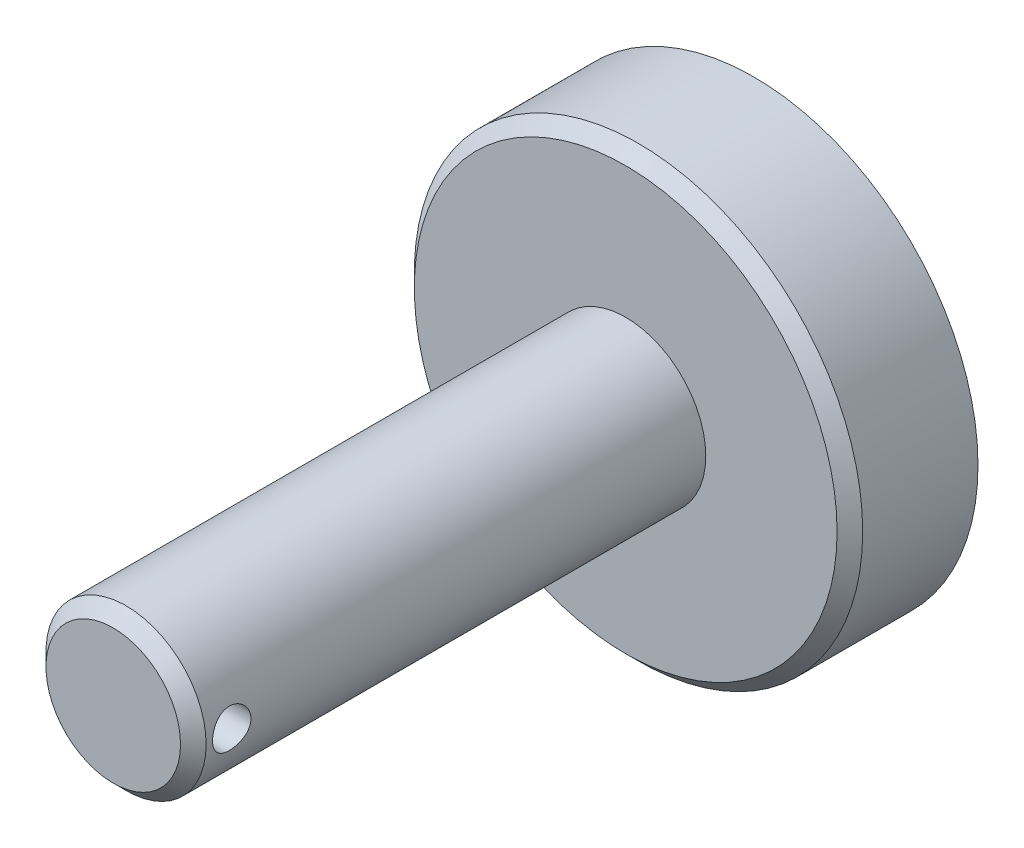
ISO-10303-21;
HEADER;
FILE_DESCRIPTION(('STEP AP214'),'2;1');
FILE_NAME('part.step','',(''),(''),'','','');
FILE_SCHEMA(('AUTOMOTIVE_DESIGN { 1 0 10303 214 1 1 1 1 }'));
ENDSEC;
DATA;
#1=APPLICATION_CONTEXT('core data for automotive mechanical design processes');
#2=APPLICATION_PROTOCOL_DEFINITION('international standard','automotive_design',2000,#1);
#3=PRODUCT_CONTEXT('',#1,'mechanical');
#4=PRODUCT('Part','Part','',(#3));
#5=PRODUCT_RELATED_PRODUCT_CATEGORY('part','',(#4));
#6=PRODUCT_DEFINITION_FORMATION('','',#4);
#7=PRODUCT_DEFINITION_CONTEXT('part definition',#1,'design');
#8=PRODUCT_DEFINITION('design','',#6,#7);
#9=PRODUCT_DEFINITION_SHAPE('','',#8);
#10=(LENGTH_UNIT() NAMED_UNIT(*) SI_UNIT(.MILLI.,.METRE.));
#11=(NAMED_UNIT(*) PLANE_ANGLE_UNIT() SI_UNIT($,.RADIAN.));
#12=(NAMED_UNIT(*) SI_UNIT($,.STERADIAN.) SOLID_ANGLE_UNIT());
#13=UNCERTAINTY_MEASURE_WITH_UNIT(LENGTH_MEASURE(1.E-05),#10,'distance_accuracy_value','');
#14=(GEOMETRIC_REPRESENTATION_CONTEXT(3) GLOBAL_UNCERTAINTY_ASSIGNED_CONTEXT((#13)) GLOBAL_UNIT_ASSIGNED_CONTEXT((#10,
#11,#12)) REPRESENTATION_CONTEXT('',''));
#15=CARTESIAN_POINT('',(0.,0.,0.));
#16=DIRECTION('',(0.,0.,1.));
#17=DIRECTION('',(1.,0.,0.));
#18=AXIS2_PLACEMENT_3D('',#15,#16,#17);
#19=CARTESIAN_POINT('',(0.,0.,20.));
#20=DIRECTION('',(0.,0.,1.));
#21=DIRECTION('',(1.,0.,0.));
#22=AXIS2_PLACEMENT_3D('',#19,#20,#21);
#23=PLANE('',#22);
#24=CARTESIAN_POINT('',(0.,0.,20.));
#25=DIRECTION('',(0.,0.,1.));
#26=DIRECTION('',(1.,0.,0.));
#27=AXIS2_PLACEMENT_3D('',#24,#25,#26);
#28=CIRCLE('',#27,33.);
#29=CARTESIAN_POINT('',(33.,0.,20.));
#30=VERTEX_POINT('',#29);
#31=EDGE_CURVE('E43',#30,#30,#28,.T.);
#32=ORIENTED_EDGE('',*,*,#31,.T.);
#33=EDGE_LOOP('',(#32));
#34=FACE_BOUND('',#33,.T.);
#35=CARTESIAN_POINT('',(0.,0.,20.));
#36=DIRECTION('',(0.,0.,1.));
#37=DIRECTION('',(1.,0.,0.));
#38=AXIS2_PLACEMENT_3D('',#35,#36,#37);
#39=CIRCLE('',#38,12.5);
#40=CARTESIAN_POINT('',(12.5,0.,20.));
#41=VERTEX_POINT('',#40);
#42=EDGE_CURVE('E96',#41,#41,#39,.T.);
#43=ORIENTED_EDGE('',*,*,#42,.F.);
#44=EDGE_LOOP('',(#43));
#45=FACE_BOUND('',#44,.T.);
#46=ADVANCED_FACE('F31',(#34,#45),#23,.T.);
#47=CARTESIAN_POINT('',(0.,0.,20.));
#48=DIRECTION('',(0.,0.,-1.));
#49=DIRECTION('',(-1.,0.,0.));
#50=AXIS2_PLACEMENT_3D('',#47,#48,#49);
#51=CYLINDRICAL_SURFACE('',#50,35.);
#52=CARTESIAN_POINT('',(0.,0.,18.));
#53=DIRECTION('',(0.,0.,1.));
#54=DIRECTION('',(1.,0.,0.));
#55=AXIS2_PLACEMENT_3D('',#52,#53,#54);
#56=CIRCLE('',#55,35.);
#57=CARTESIAN_POINT('',(35.,0.,18.));
#58=VERTEX_POINT('',#57);
#59=EDGE_CURVE('E10',#58,#58,#56,.F.);
#60=ORIENTED_EDGE('',*,*,#59,.T.);
#61=EDGE_LOOP('',(#60));
#62=FACE_BOUND('',#61,.T.);
#63=CARTESIAN_POINT('',(0.,0.,0.));
#64=DIRECTION('',(0.,0.,1.));
#65=DIRECTION('',(1.,0.,0.));
#66=AXIS2_PLACEMENT_3D('',#63,#64,#65);
#67=CIRCLE('',#66,35.);
#68=CARTESIAN_POINT('',(35.,0.,0.));
#69=VERTEX_POINT('',#68);
#70=EDGE_CURVE('E93',#69,#69,#67,.T.);
#71=ORIENTED_EDGE('',*,*,#70,.T.);
#72=EDGE_LOOP('',(#71));
#73=FACE_BOUND('',#72,.T.);
#74=ADVANCED_FACE('F33',(#62,#73),#51,.T.);
#75=CARTESIAN_POINT('',(0.,0.,0.));
#76=DIRECTION('',(0.,0.,1.));
#77=DIRECTION('',(1.,0.,0.));
#78=AXIS2_PLACEMENT_3D('',#75,#76,#77);
#79=PLANE('',#78);
#80=ORIENTED_EDGE('',*,*,#70,.F.);
#81=EDGE_LOOP('',(#80));
#82=FACE_BOUND('',#81,.T.);
#83=ADVANCED_FACE('F78',(#82),#79,.F.);
#84=CARTESIAN_POINT('',(0.,0.,100.));
#85=DIRECTION('',(0.,0.,-1.));
#86=DIRECTION('',(-1.,0.,0.));
#87=AXIS2_PLACEMENT_3D('',#84,#85,#86);
#88=CYLINDRICAL_SURFACE('',#87,12.5);
#89=CARTESIAN_POINT('',(-12.5,0.,97.));
#90=CARTESIAN_POINT('',(-12.4999970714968,-0.165963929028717,96.9999949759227));
#91=CARTESIAN_POINT('',(-12.4966615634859,-0.331985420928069,96.9861815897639));
#92=CARTESIAN_POINT('',(-12.4836783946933,-0.659284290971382,96.9313672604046));
#93=CARTESIAN_POINT('',(-12.4740268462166,-0.820558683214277,96.8903495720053));
#94=CARTESIAN_POINT('',(-12.4494823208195,-1.13358839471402,96.7825076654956));
#95=CARTESIAN_POINT('',(-12.4345953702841,-1.28535442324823,96.7157131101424));
#96=CARTESIAN_POINT('',(-12.4011725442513,-1.57552517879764,96.5583145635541));
#97=CARTESIAN_POINT('',(-12.3826366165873,-1.71392971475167,96.4677102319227));
#98=CARTESIAN_POINT('',(-12.3435386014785,-1.97609263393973,96.2634358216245));
#99=CARTESIAN_POINT('',(-12.3229472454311,-2.09955952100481,96.1493972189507));
#100=CARTESIAN_POINT('',(-12.2822574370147,-2.32581080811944,95.9022811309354));
#101=CARTESIAN_POINT('',(-12.2621590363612,-2.4285930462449,95.7692016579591));
#102=CARTESIAN_POINT('',(-12.224437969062,-2.61189993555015,95.4855541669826));
#103=CARTESIAN_POINT('',(-12.2068525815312,-2.69210377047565,95.3347734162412));
#104=CARTESIAN_POINT('',(-12.1765733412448,-2.82591582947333,95.0213801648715));
#105=CARTESIAN_POINT('',(-12.1638787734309,-2.87952794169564,94.8587693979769));
#106=CARTESIAN_POINT('',(-12.1451184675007,-2.95765058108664,94.5295234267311));
#107=CARTESIAN_POINT('',(-12.1389341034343,-2.98268262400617,94.3630188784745));
#108=CARTESIAN_POINT('',(-12.1335389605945,-3.00455808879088,94.0280676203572));
#109=CARTESIAN_POINT('',(-12.1343271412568,-3.001405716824,93.8596212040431));
#110=CARTESIAN_POINT('',(-12.1426811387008,-2.96741912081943,93.5295240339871));
#111=CARTESIAN_POINT('',(-12.1500960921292,-2.93720103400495,93.3678054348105));
#112=CARTESIAN_POINT('',(-12.1706283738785,-2.8509214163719,93.0518026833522));
#113=CARTESIAN_POINT('',(-12.1837460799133,-2.79485817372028,92.8975190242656));
#114=CARTESIAN_POINT('',(-12.2143476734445,-2.65794121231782,92.5990870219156));
#115=CARTESIAN_POINT('',(-12.2318714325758,-2.5768594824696,92.4550475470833));
#116=CARTESIAN_POINT('',(-12.2692875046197,-2.39236688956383,92.1823954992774));
#117=CARTESIAN_POINT('',(-12.2891802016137,-2.28895240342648,92.0537854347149));
#118=CARTESIAN_POINT('',(-12.329732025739,-2.05951493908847,91.8121064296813));
#119=CARTESIAN_POINT('',(-12.3503975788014,-1.93297064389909,91.6995329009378));
#120=CARTESIAN_POINT('',(-12.3896951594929,-1.66255592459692,91.4971152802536));
#121=CARTESIAN_POINT('',(-12.4083271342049,-1.51868504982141,91.4072717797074));
#122=CARTESIAN_POINT('',(-12.4415394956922,-1.21702847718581,91.2527027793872));
#123=CARTESIAN_POINT('',(-12.4561077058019,-1.05920278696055,91.1880525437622));
#124=CARTESIAN_POINT('',(-12.4794620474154,-0.73449760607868,91.0863349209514));
#125=CARTESIAN_POINT('',(-12.4882491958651,-0.567619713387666,91.0492626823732));
#126=CARTESIAN_POINT('',(-12.4989027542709,-0.233787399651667,91.004497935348));
#127=CARTESIAN_POINT('',(-12.5009282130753,-0.0669284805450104,90.9961301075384));
#128=CARTESIAN_POINT('',(-12.4982807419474,0.265804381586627,91.0071667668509));
#129=CARTESIAN_POINT('',(-12.4936083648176,0.43167840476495,91.0265689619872));
#130=CARTESIAN_POINT('',(-12.4781916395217,0.755422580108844,91.0920369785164));
#131=CARTESIAN_POINT('',(-12.4675301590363,0.913370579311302,91.1377391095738));
#132=CARTESIAN_POINT('',(-12.4413335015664,1.21935330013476,91.2540981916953));
#133=CARTESIAN_POINT('',(-12.4257978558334,1.3673870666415,91.3247575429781));
#134=CARTESIAN_POINT('',(-12.3911910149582,1.6520615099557,91.4903665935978));
#135=CARTESIAN_POINT('',(-12.3720653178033,1.78847176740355,91.5857007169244));
#136=CARTESIAN_POINT('',(-12.3324936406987,2.04359904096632,91.7974569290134));
#137=CARTESIAN_POINT('',(-12.3120474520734,2.16231325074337,91.9138823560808));
#138=CARTESIAN_POINT('',(-12.2715742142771,2.38142453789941,92.1676408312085));
#139=CARTESIAN_POINT('',(-12.2515669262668,2.4813497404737,92.3053851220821));
#140=CARTESIAN_POINT('',(-12.2147538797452,2.65666020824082,92.5960904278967));
#141=CARTESIAN_POINT('',(-12.1979479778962,2.7320465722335,92.7490507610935));
#142=CARTESIAN_POINT('',(-12.1696189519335,2.85558993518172,93.065012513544));
#143=CARTESIAN_POINT('',(-12.1580647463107,2.90390754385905,93.2279482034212));
#144=CARTESIAN_POINT('',(-12.1415072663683,2.97238380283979,93.5599461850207));
#145=CARTESIAN_POINT('',(-12.1365026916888,2.99254804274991,93.7290072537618));
#146=CARTESIAN_POINT('',(-12.1337046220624,3.00387066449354,94.0636707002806));
#147=CARTESIAN_POINT('',(-12.1357241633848,2.99578106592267,94.2292464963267));
#148=CARTESIAN_POINT('',(-12.1463176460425,2.95253345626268,94.5565997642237));
#149=CARTESIAN_POINT('',(-12.1548914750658,2.91737590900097,94.7183773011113));
#150=CARTESIAN_POINT('',(-12.1775274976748,2.82138591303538,95.0327975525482));
#151=CARTESIAN_POINT('',(-12.191561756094,2.76068402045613,95.1854822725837));
#152=CARTESIAN_POINT('',(-12.2235433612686,2.61543373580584,95.4786044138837));
#153=CARTESIAN_POINT('',(-12.2414912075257,2.53088229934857,95.6190402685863));
#154=CARTESIAN_POINT('',(-12.279819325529,2.33793007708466,95.8873370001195));
#155=CARTESIAN_POINT('',(-12.3002478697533,2.2290026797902,96.0148123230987));
#156=CARTESIAN_POINT('',(-12.3409359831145,1.99143074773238,96.2499199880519));
#157=CARTESIAN_POINT('',(-12.361195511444,1.86278158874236,96.3575476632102));
#158=CARTESIAN_POINT('',(-12.3996570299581,1.58688299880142,96.5516092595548));
#159=CARTESIAN_POINT('',(-12.4178200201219,1.43936414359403,96.637668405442));
#160=CARTESIAN_POINT('',(-12.4496380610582,1.13153622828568,96.7836295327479));
#161=CARTESIAN_POINT('',(-12.4632965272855,0.97123697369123,96.8435513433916));
#162=CARTESIAN_POINT('',(-12.4824059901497,0.675887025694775,96.9260386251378));
#163=CARTESIAN_POINT('',(-12.4889599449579,0.542312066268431,96.9537166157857));
#164=CARTESIAN_POINT('',(-12.4977580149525,0.272504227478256,96.9906987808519));
#165=CARTESIAN_POINT('',(-12.5000024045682,0.13627151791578,97.0000041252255));
#166=CARTESIAN_POINT('',(-12.5,0.,97.));
#167=B_SPLINE_CURVE_WITH_KNOTS('',3,(#89,#90,#91,#92,#93,#94,#95,#96,#97,#98,#99,#100,#101,#102,
#103,#104,#105,#106,#107,#108,#109,#110,#111,#112,#113,#114,#115,#116,#117,#118,#119,#120,#121,
#122,#123,#124,#125,#126,#127,#128,#129,#130,#131,#132,#133,#134,#135,#136,#137,#138,#139,#140,
#141,#142,#143,#144,#145,#146,#147,#148,#149,#150,#151,#152,#153,#154,#155,#156,#157,#158,#159,
#160,#161,#162,#163,#164,#165,#166),.UNSPECIFIED.,.T.,.F.,(4,2,2,2,2,2,2,2,2,2,2,2,2,2,2,2,2,2,
2,2,2,2,2,2,2,2,2,2,2,2,2,2,2,2,2,2,2,2,4),(0.,0.497392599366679,0.995091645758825,
1.49221966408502,1.9893547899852,2.49500570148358,3.00070943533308,3.51327262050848,
4.02576083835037,4.52873995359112,5.03164400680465,5.52338274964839,6.0151540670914,
6.51154667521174,7.00801987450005,7.51749958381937,8.02699254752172,8.53799614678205,
9.04890983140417,9.54771776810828,10.0464845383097,10.5385143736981,11.0305915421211,
11.5308523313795,12.0311923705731,12.5427824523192,13.0543496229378,13.5628484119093,
14.0712462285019,14.5662165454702,15.06117838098,15.5536406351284,16.0461657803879,
16.5505844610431,17.055121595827,17.5678974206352,18.0802835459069,18.4887142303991,
18.8971189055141),.UNSPECIFIED.);
#168=CARTESIAN_POINT('',(-12.5,0.,97.));
#169=VERTEX_POINT('',#168);
#170=EDGE_CURVE('E35',#169,#169,#167,.T.);
#171=ORIENTED_EDGE('',*,*,#170,.T.);
#172=EDGE_LOOP('',(#171));
#173=FACE_BOUND('',#172,.T.);
#174=CARTESIAN_POINT('',(12.5,0.,91.));
#175=CARTESIAN_POINT('',(12.4999970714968,-0.165963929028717,91.0000050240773));
#176=CARTESIAN_POINT('',(12.4966615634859,-0.331985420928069,91.0138184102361));
#177=CARTESIAN_POINT('',(12.4836783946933,-0.659284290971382,91.0686327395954));
#178=CARTESIAN_POINT('',(12.4740268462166,-0.820558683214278,91.1096504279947));
#179=CARTESIAN_POINT('',(12.4494823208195,-1.13358839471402,91.2174923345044));
#180=CARTESIAN_POINT('',(12.4345953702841,-1.28535442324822,91.2842868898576));
#181=CARTESIAN_POINT('',(12.4011725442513,-1.57552517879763,91.4416854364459));
#182=CARTESIAN_POINT('',(12.3826366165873,-1.71392971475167,91.5322897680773));
#183=CARTESIAN_POINT('',(12.3435386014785,-1.97609263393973,91.7365641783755));
#184=CARTESIAN_POINT('',(12.3229472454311,-2.0995595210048,91.8506027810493));
#185=CARTESIAN_POINT('',(12.2822574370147,-2.32581080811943,92.0977188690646));
#186=CARTESIAN_POINT('',(12.2621590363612,-2.4285930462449,92.2307983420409));
#187=CARTESIAN_POINT('',(12.224437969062,-2.61189993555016,92.5144458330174));
#188=CARTESIAN_POINT('',(12.2068525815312,-2.69210377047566,92.6652265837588));
#189=CARTESIAN_POINT('',(12.1765733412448,-2.82591582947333,92.9786198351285));
#190=CARTESIAN_POINT('',(12.1638787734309,-2.87952794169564,93.1412306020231));
#191=CARTESIAN_POINT('',(12.1451184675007,-2.95765058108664,93.4704765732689));
#192=CARTESIAN_POINT('',(12.1389341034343,-2.98268262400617,93.6369811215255));
#193=CARTESIAN_POINT('',(12.1335389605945,-3.00455808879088,93.9719323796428));
#194=CARTESIAN_POINT('',(12.1343271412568,-3.001405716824,94.1403787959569));
#195=CARTESIAN_POINT('',(12.1426811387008,-2.96741912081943,94.4704759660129));
#196=CARTESIAN_POINT('',(12.1500960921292,-2.93720103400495,94.6321945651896));
#197=CARTESIAN_POINT('',(12.1706283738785,-2.85092141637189,94.9481973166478));
#198=CARTESIAN_POINT('',(12.1837460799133,-2.79485817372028,95.1024809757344));
#199=CARTESIAN_POINT('',(12.2143476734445,-2.65794121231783,95.4009129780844));
#200=CARTESIAN_POINT('',(12.2318714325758,-2.57685948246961,95.5449524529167));
#201=CARTESIAN_POINT('',(12.2692875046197,-2.39236688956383,95.8176045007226));
#202=CARTESIAN_POINT('',(12.2891802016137,-2.28895240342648,95.9462145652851));
#203=CARTESIAN_POINT('',(12.329732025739,-2.05951493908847,96.1878935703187));
#204=CARTESIAN_POINT('',(12.3503975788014,-1.93297064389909,96.3004670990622));
#205=CARTESIAN_POINT('',(12.3896951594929,-1.66255592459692,96.5028847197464));
#206=CARTESIAN_POINT('',(12.4083271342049,-1.51868504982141,96.5927282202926));
#207=CARTESIAN_POINT('',(12.4415394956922,-1.21702847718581,96.7472972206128));
#208=CARTESIAN_POINT('',(12.4561077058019,-1.05920278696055,96.8119474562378));
#209=CARTESIAN_POINT('',(12.4794620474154,-0.73449760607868,96.9136650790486));
#210=CARTESIAN_POINT('',(12.4882491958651,-0.567619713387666,96.9507373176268));
#211=CARTESIAN_POINT('',(12.4989027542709,-0.233787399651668,96.995502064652));
#212=CARTESIAN_POINT('',(12.5009282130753,-0.0669284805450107,97.0038698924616));
#213=CARTESIAN_POINT('',(12.4982807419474,0.265804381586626,96.9928332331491));
#214=CARTESIAN_POINT('',(12.4936083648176,0.431678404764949,96.9734310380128));
#215=CARTESIAN_POINT('',(12.4781916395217,0.755422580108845,96.9079630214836));
#216=CARTESIAN_POINT('',(12.4675301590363,0.913370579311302,96.8622608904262));
#217=CARTESIAN_POINT('',(12.4413335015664,1.21935330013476,96.7459018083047));
#218=CARTESIAN_POINT('',(12.4257978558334,1.3673870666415,96.6752424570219));
#219=CARTESIAN_POINT('',(12.3911910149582,1.6520615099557,96.5096334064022));
#220=CARTESIAN_POINT('',(12.3720653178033,1.78847176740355,96.4142992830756));
#221=CARTESIAN_POINT('',(12.3324936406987,2.04359904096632,96.2025430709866));
#222=CARTESIAN_POINT('',(12.3120474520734,2.16231325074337,96.0861176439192));
#223=CARTESIAN_POINT('',(12.2715742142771,2.38142453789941,95.8323591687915));
#224=CARTESIAN_POINT('',(12.2515669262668,2.4813497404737,95.6946148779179));
#225=CARTESIAN_POINT('',(12.2147538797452,2.65666020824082,95.4039095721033));
#226=CARTESIAN_POINT('',(12.1979479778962,2.7320465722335,95.2509492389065));
#227=CARTESIAN_POINT('',(12.1696189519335,2.85558993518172,94.934987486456));
#228=CARTESIAN_POINT('',(12.1580647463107,2.90390754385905,94.7720517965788));
#229=CARTESIAN_POINT('',(12.1415072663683,2.97238380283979,94.4400538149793));
#230=CARTESIAN_POINT('',(12.1365026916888,2.99254804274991,94.2709927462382));
#231=CARTESIAN_POINT('',(12.1337046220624,3.00387066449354,93.9363292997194));
#232=CARTESIAN_POINT('',(12.1357241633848,2.99578106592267,93.7707535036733));
#233=CARTESIAN_POINT('',(12.1463176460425,2.95253345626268,93.4434002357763));
#234=CARTESIAN_POINT('',(12.1548914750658,2.91737590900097,93.2816226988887));
#235=CARTESIAN_POINT('',(12.1775274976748,2.82138591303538,92.9672024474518));
#236=CARTESIAN_POINT('',(12.191561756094,2.76068402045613,92.8145177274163));
#237=CARTESIAN_POINT('',(12.2235433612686,2.61543373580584,92.5213955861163));
#238=CARTESIAN_POINT('',(12.2414912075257,2.53088229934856,92.3809597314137));
#239=CARTESIAN_POINT('',(12.279819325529,2.33793007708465,92.1126629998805));
#240=CARTESIAN_POINT('',(12.3002478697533,2.2290026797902,91.9851876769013));
#241=CARTESIAN_POINT('',(12.3409359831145,1.99143074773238,91.7500800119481));
#242=CARTESIAN_POINT('',(12.361195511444,1.86278158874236,91.6424523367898));
#243=CARTESIAN_POINT('',(12.3996570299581,1.58688299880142,91.4483907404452));
#244=CARTESIAN_POINT('',(12.4178200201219,1.43936414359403,91.362331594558));
#245=CARTESIAN_POINT('',(12.4496380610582,1.13153622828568,91.2163704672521));
#246=CARTESIAN_POINT('',(12.4632965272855,0.971236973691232,91.1564486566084));
#247=CARTESIAN_POINT('',(12.4824059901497,0.675887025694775,91.0739613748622));
#248=CARTESIAN_POINT('',(12.4889599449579,0.542312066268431,91.0462833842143));
#249=CARTESIAN_POINT('',(12.4977580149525,0.272504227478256,91.0093012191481));
#250=CARTESIAN_POINT('',(12.5000024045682,0.13627151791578,90.9999958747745));
#251=CARTESIAN_POINT('',(12.5,0.,91.));
#252=B_SPLINE_CURVE_WITH_KNOTS('',3,(#174,#175,#176,#177,#178,#179,#180,#181,#182,#183,#184,
#185,#186,#187,#188,#189,#190,#191,#192,#193,#194,#195,#196,#197,#198,#199,#200,#201,#202,#203,
#204,#205,#206,#207,#208,#209,#210,#211,#212,#213,#214,#215,#216,#217,#218,#219,#220,#221,#222,
#223,#224,#225,#226,#227,#228,#229,#230,#231,#232,#233,#234,#235,#236,#237,#238,#239,#240,#241,
#242,#243,#244,#245,#246,#247,#248,#249,#250,#251),.UNSPECIFIED.,.T.,.F.,(4,2,2,2,2,2,2,2,2,2,2,
2,2,2,2,2,2,2,2,2,2,2,2,2,2,2,2,2,2,2,2,2,2,2,2,2,2,2,4),(0.,0.497392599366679,
0.995091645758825,1.49221966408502,1.9893547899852,2.49500570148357,3.00070943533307,
3.51327262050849,4.02576083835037,4.52873995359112,5.03164400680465,5.5233827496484,
6.0151540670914,6.51154667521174,7.00801987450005,7.51749958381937,8.02699254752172,
8.53799614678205,9.04890983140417,9.54771776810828,10.0464845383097,10.5385143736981,
11.0305915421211,11.5308523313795,12.0311923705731,12.5427824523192,13.0543496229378,
13.5628484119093,14.0712462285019,14.5662165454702,15.06117838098,15.5536406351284,
16.0461657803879,16.5505844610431,17.055121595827,17.5678974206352,18.0802835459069,
18.4887142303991,18.8971189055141),.UNSPECIFIED.);
#253=CARTESIAN_POINT('',(12.5,0.,91.));
#254=VERTEX_POINT('',#253);
#255=EDGE_CURVE('E51',#254,#254,#252,.T.);
#256=ORIENTED_EDGE('',*,*,#255,.T.);
#257=EDGE_LOOP('',(#256));
#258=FACE_BOUND('',#257,.T.);
#259=CARTESIAN_POINT('',(0.,0.,98.));
#260=DIRECTION('',(0.,0.,1.));
#261=DIRECTION('',(1.,0.,0.));
#262=AXIS2_PLACEMENT_3D('',#259,#260,#261);
#263=CIRCLE('',#262,12.5);
#264=CARTESIAN_POINT('',(12.5,0.,98.));
#265=VERTEX_POINT('',#264);
#266=EDGE_CURVE('E48',#265,#265,#263,.F.);
#267=ORIENTED_EDGE('',*,*,#266,.T.);
#268=EDGE_LOOP('',(#267));
#269=FACE_BOUND('',#268,.T.);
#270=ORIENTED_EDGE('',*,*,#42,.T.);
#271=EDGE_LOOP('',(#270));
#272=FACE_BOUND('',#271,.T.);
#273=ADVANCED_FACE('F55',(#173,#258,#269,#272),#88,.T.);
#274=CARTESIAN_POINT('',(0.,0.,100.));
#275=DIRECTION('',(0.,0.,1.));
#276=DIRECTION('',(1.,0.,0.));
#277=AXIS2_PLACEMENT_3D('',#274,#275,#276);
#278=PLANE('',#277);
#279=CARTESIAN_POINT('',(0.,0.,100.));
#280=DIRECTION('',(0.,0.,1.));
#281=DIRECTION('',(1.,0.,0.));
#282=AXIS2_PLACEMENT_3D('',#279,#280,#281);
#283=CIRCLE('',#282,10.5);
#284=CARTESIAN_POINT('',(10.5,0.,100.));
#285=VERTEX_POINT('',#284);
#286=EDGE_CURVE('E95',#285,#285,#283,.T.);
#287=ORIENTED_EDGE('',*,*,#286,.T.);
#288=EDGE_LOOP('',(#287));
#289=FACE_BOUND('',#288,.T.);
#290=ADVANCED_FACE('F71',(#289),#278,.T.);
#291=CARTESIAN_POINT('',(0.,0.,100.));
#292=DIRECTION('',(0.,0.,-1.));
#293=DIRECTION('',(-1.,0.,0.));
#294=AXIS2_PLACEMENT_3D('',#291,#292,#293);
#295=CONICAL_SURFACE('',#294,10.5,0.785398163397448);
#296=ORIENTED_EDGE('',*,*,#266,.F.);
#297=EDGE_LOOP('',(#296));
#298=FACE_BOUND('',#297,.T.);
#299=ORIENTED_EDGE('',*,*,#286,.F.);
#300=EDGE_LOOP('',(#299));
#301=FACE_BOUND('',#300,.T.);
#302=ADVANCED_FACE('F68',(#298,#301),#295,.T.);
#303=CARTESIAN_POINT('',(0.,0.,20.));
#304=DIRECTION('',(0.,0.,-1.));
#305=DIRECTION('',(-1.,0.,0.));
#306=AXIS2_PLACEMENT_3D('',#303,#304,#305);
#307=CONICAL_SURFACE('',#306,33.,0.785398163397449);
#308=ORIENTED_EDGE('',*,*,#59,.F.);
#309=EDGE_LOOP('',(#308));
#310=FACE_BOUND('',#309,.T.);
#311=ORIENTED_EDGE('',*,*,#31,.F.);
#312=EDGE_LOOP('',(#311));
#313=FACE_BOUND('',#312,.T.);
#314=ADVANCED_FACE('F63',(#310,#313),#307,.T.);
#315=CARTESIAN_POINT('',(-15.,0.,94.));
#316=DIRECTION('',(1.,0.,0.));
#317=DIRECTION('',(0.,0.,-1.));
#318=AXIS2_PLACEMENT_3D('',#315,#316,#317);
#319=CYLINDRICAL_SURFACE('',#318,3.00000000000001);
#320=ORIENTED_EDGE('',*,*,#255,.F.);
#321=EDGE_LOOP('',(#320));
#322=FACE_BOUND('',#321,.T.);
#323=ORIENTED_EDGE('',*,*,#170,.F.);
#324=EDGE_LOOP('',(#323));
#325=FACE_BOUND('',#324,.T.);
#326=ADVANCED_FACE('F59',(#322,#325),#319,.F.);
#327=CLOSED_SHELL('',(#46,#74,#83,#273,#290,#302,#314,#326));
#328=MANIFOLD_SOLID_BREP('B2',#327);
#329=ADVANCED_BREP_SHAPE_REPRESENTATION('',(#18,#328),#14);
#330=SHAPE_DEFINITION_REPRESENTATION(#9,#329);
ENDSEC;
END-ISO-10303-21;
